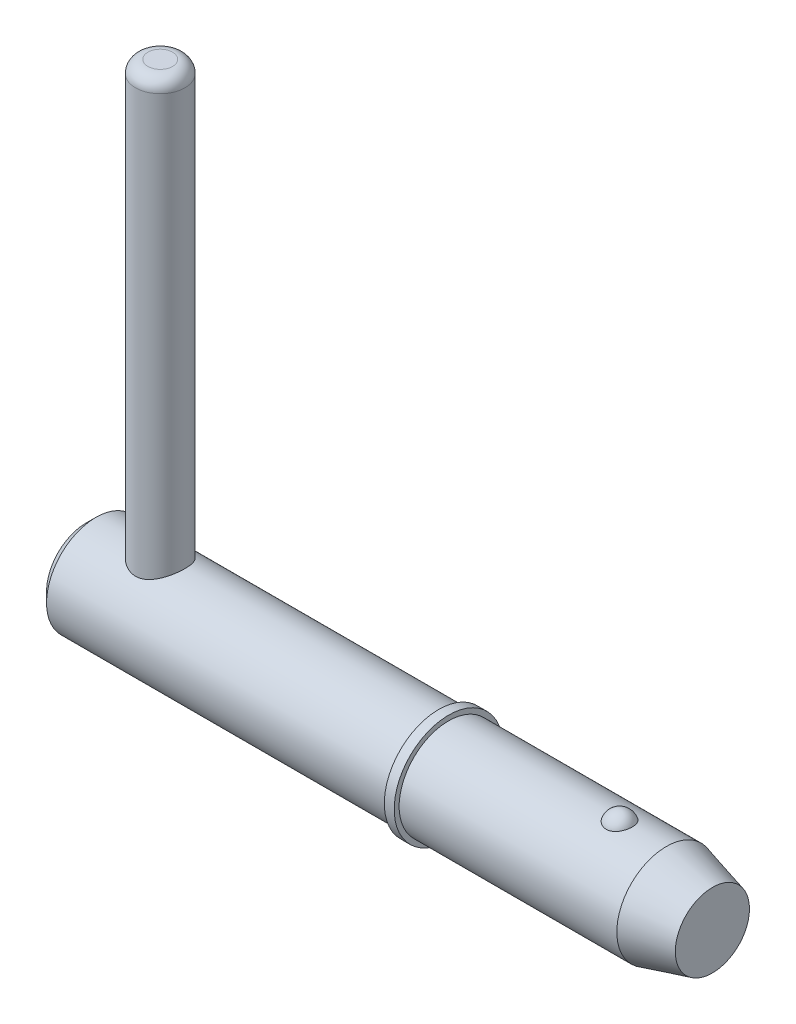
ISO-10303-21;
HEADER;
FILE_DESCRIPTION(('STEP AP214'),'2;1');
FILE_NAME('part.step','',(''),(''),'','','');
FILE_SCHEMA(('AUTOMOTIVE_DESIGN { 1 0 10303 214 1 1 1 1 }'));
ENDSEC;
DATA;
#1=APPLICATION_CONTEXT('core data for automotive mechanical design processes');
#2=APPLICATION_PROTOCOL_DEFINITION('international standard','automotive_design',2000,#1);
#3=PRODUCT_CONTEXT('',#1,'mechanical');
#4=PRODUCT('Part','Part','',(#3));
#5=PRODUCT_RELATED_PRODUCT_CATEGORY('part','',(#4));
#6=PRODUCT_DEFINITION_FORMATION('','',#4);
#7=PRODUCT_DEFINITION_CONTEXT('part definition',#1,'design');
#8=PRODUCT_DEFINITION('design','',#6,#7);
#9=PRODUCT_DEFINITION_SHAPE('','',#8);
#10=(LENGTH_UNIT() NAMED_UNIT(*) SI_UNIT(.MILLI.,.METRE.));
#11=(NAMED_UNIT(*) PLANE_ANGLE_UNIT() SI_UNIT($,.RADIAN.));
#12=(NAMED_UNIT(*) SI_UNIT($,.STERADIAN.) SOLID_ANGLE_UNIT());
#13=UNCERTAINTY_MEASURE_WITH_UNIT(LENGTH_MEASURE(1.E-05),#10,'distance_accuracy_value','');
#14=(GEOMETRIC_REPRESENTATION_CONTEXT(3) GLOBAL_UNCERTAINTY_ASSIGNED_CONTEXT((#13)) GLOBAL_UNIT_ASSIGNED_CONTEXT((#10,
#11,#12)) REPRESENTATION_CONTEXT('',''));
#15=CARTESIAN_POINT('',(0.,0.,0.));
#16=DIRECTION('',(0.,0.,1.));
#17=DIRECTION('',(1.,0.,0.));
#18=AXIS2_PLACEMENT_3D('',#15,#16,#17);
#19=CARTESIAN_POINT('',(3.57,23.02,0.));
#20=DIRECTION('',(0.,-1.,0.));
#21=DIRECTION('',(0.,0.,-1.));
#22=AXIS2_PLACEMENT_3D('',#19,#20,#21);
#23=CYLINDRICAL_SURFACE('',#22,1.19);
#24=CARTESIAN_POINT('',(3.57,-1.785,0.));
#25=DIRECTION('',(0.,1.,0.));
#26=DIRECTION('',(0.,0.,1.));
#27=AXIS2_PLACEMENT_3D('',#24,#25,#26);
#28=CIRCLE('',#27,1.19);
#29=CARTESIAN_POINT('',(3.57,-1.785,1.19));
#30=VERTEX_POINT('',#29);
#31=EDGE_CURVE('P0_E25',#30,#30,#28,.T.);
#32=ORIENTED_EDGE('',*,*,#31,.T.);
#33=EDGE_LOOP('',(#32));
#34=FACE_BOUND('',#33,.T.);
#35=CARTESIAN_POINT('',(3.57,22.425,0.));
#36=DIRECTION('',(0.,1.,0.));
#37=DIRECTION('',(0.,0.,1.));
#38=AXIS2_PLACEMENT_3D('',#35,#36,#37);
#39=CIRCLE('',#38,1.19);
#40=CARTESIAN_POINT('',(3.57,22.425,1.19));
#41=VERTEX_POINT('',#40);
#42=EDGE_CURVE('P0_E29',#41,#41,#39,.F.);
#43=ORIENTED_EDGE('',*,*,#42,.T.);
#44=EDGE_LOOP('',(#43));
#45=FACE_BOUND('',#44,.T.);
#46=ADVANCED_FACE('P0_F14',(#34,#45),#23,.T.);
#47=CARTESIAN_POINT('',(3.57,23.02,0.));
#48=DIRECTION('',(0.,1.,0.));
#49=DIRECTION('',(0.,0.,1.));
#50=AXIS2_PLACEMENT_3D('',#47,#48,#49);
#51=PLANE('',#50);
#52=CARTESIAN_POINT('',(3.57,23.02,0.));
#53=DIRECTION('',(0.,1.,0.));
#54=DIRECTION('',(0.,0.,1.));
#55=AXIS2_PLACEMENT_3D('',#52,#53,#54);
#56=CIRCLE('',#55,0.595);
#57=CARTESIAN_POINT('',(3.57,23.02,0.595));
#58=VERTEX_POINT('',#57);
#59=EDGE_CURVE('P0_E10',#58,#58,#56,.T.);
#60=ORIENTED_EDGE('',*,*,#59,.T.);
#61=EDGE_LOOP('',(#60));
#62=FACE_BOUND('',#61,.T.);
#63=ADVANCED_FACE('P0_F46',(#62),#51,.T.);
#64=CARTESIAN_POINT('',(3.57,-2.38,0.));
#65=DIRECTION('',(0.,1.,0.));
#66=DIRECTION('',(0.,0.,1.));
#67=AXIS2_PLACEMENT_3D('',#64,#65,#66);
#68=PLANE('',#67);
#69=CARTESIAN_POINT('',(3.57,-2.38,0.));
#70=DIRECTION('',(0.,1.,0.));
#71=DIRECTION('',(0.,0.,1.));
#72=AXIS2_PLACEMENT_3D('',#69,#70,#71);
#73=CIRCLE('',#72,0.595);
#74=CARTESIAN_POINT('',(3.57,-2.38,0.595));
#75=VERTEX_POINT('',#74);
#76=EDGE_CURVE('P0_E21',#75,#75,#73,.F.);
#77=ORIENTED_EDGE('',*,*,#76,.T.);
#78=EDGE_LOOP('',(#77));
#79=FACE_BOUND('',#78,.T.);
#80=ADVANCED_FACE('P0_F43',(#79),#68,.F.);
#81=CARTESIAN_POINT('',(3.57,-1.785,0.));
#82=DIRECTION('',(0.,1.,0.));
#83=DIRECTION('',(0.,0.,1.));
#84=AXIS2_PLACEMENT_3D('',#81,#82,#83);
#85=DEGENERATE_TOROIDAL_SURFACE('',#84,0.595,0.595,.T.);
#86=ORIENTED_EDGE('',*,*,#76,.F.);
#87=EDGE_LOOP('',(#86));
#88=FACE_BOUND('',#87,.T.);
#89=ORIENTED_EDGE('',*,*,#31,.F.);
#90=EDGE_LOOP('',(#89));
#91=FACE_BOUND('',#90,.T.);
#92=ADVANCED_FACE('P0_F38',(#88,#91),#85,.T.);
#93=CARTESIAN_POINT('',(3.57,22.425,0.));
#94=DIRECTION('',(0.,1.,0.));
#95=DIRECTION('',(0.,0.,1.));
#96=AXIS2_PLACEMENT_3D('',#93,#94,#95);
#97=DEGENERATE_TOROIDAL_SURFACE('',#96,0.595,0.595,.T.);
#98=ORIENTED_EDGE('',*,*,#42,.F.);
#99=EDGE_LOOP('',(#98));
#100=FACE_BOUND('',#99,.T.);
#101=ORIENTED_EDGE('',*,*,#59,.F.);
#102=EDGE_LOOP('',(#101));
#103=FACE_BOUND('',#102,.T.);
#104=ADVANCED_FACE('P0_F16',(#100,#103),#97,.T.);
#105=CLOSED_SHELL('',(#46,#63,#80,#92,#104));
#106=MANIFOLD_SOLID_BREP('P0_B1',#105);
#107=CARTESIAN_POINT('',(0.,0.,0.));
#108=DIRECTION('',(1.,0.,0.));
#109=DIRECTION('',(0.,0.,-1.));
#110=AXIS2_PLACEMENT_3D('',#107,#108,#109);
#111=CYLINDRICAL_SURFACE('',#110,2.38);
#112=CARTESIAN_POINT('',(27.9294297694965,0.,0.));
#113=DIRECTION('',(1.,0.,0.));
#114=DIRECTION('',(0.,0.,-1.));
#115=AXIS2_PLACEMENT_3D('',#112,#113,#114);
#116=CIRCLE('',#115,2.38);
#117=CARTESIAN_POINT('',(27.9294297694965,0.,-2.38));
#118=VERTEX_POINT('',#117);
#119=EDGE_CURVE('P1_E81',#118,#118,#116,.T.);
#120=ORIENTED_EDGE('',*,*,#119,.F.);
#121=EDGE_LOOP('',(#120));
#122=FACE_BOUND('',#121,.T.);
#123=CARTESIAN_POINT('',(17.45,0.,0.));
#124=DIRECTION('',(1.,0.,0.));
#125=DIRECTION('',(0.,0.,-1.));
#126=AXIS2_PLACEMENT_3D('',#123,#124,#125);
#127=CIRCLE('',#126,2.38);
#128=CARTESIAN_POINT('',(17.45,0.,-2.38));
#129=VERTEX_POINT('',#128);
#130=EDGE_CURVE('P1_E85',#129,#129,#127,.T.);
#131=ORIENTED_EDGE('',*,*,#130,.T.);
#132=EDGE_LOOP('',(#131));
#133=FACE_BOUND('',#132,.T.);
#134=CARTESIAN_POINT('',(25.6834492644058,2.2921568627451,0.640637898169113));
#135=CARTESIAN_POINT('',(25.6503559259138,2.29215737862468,0.64063719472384));
#136=CARTESIAN_POINT('',(25.6172546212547,2.29293179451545,0.637884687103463));
#137=CARTESIAN_POINT('',(25.5520176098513,2.29594030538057,0.626968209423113));
#138=CARTESIAN_POINT('',(25.5198823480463,2.29817506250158,0.618801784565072));
#139=CARTESIAN_POINT('',(25.4575402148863,2.3038430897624,0.597351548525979));
#140=CARTESIAN_POINT('',(25.4273305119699,2.30727454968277,0.584075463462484));
#141=CARTESIAN_POINT('',(25.3695674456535,2.31495941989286,0.552829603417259));
#142=CARTESIAN_POINT('',(25.3420141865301,2.31921286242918,0.53485964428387));
#143=CARTESIAN_POINT('',(25.2895938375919,2.32820213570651,0.494282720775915));
#144=CARTESIAN_POINT('',(25.2648050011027,2.33294694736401,0.471576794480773));
#145=CARTESIAN_POINT('',(25.2192169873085,2.34234144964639,0.422446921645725));
#146=CARTESIAN_POINT('',(25.1984185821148,2.34699112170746,0.396022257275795));
#147=CARTESIAN_POINT('',(25.1603580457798,2.35593942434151,0.338855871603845));
#148=CARTESIAN_POINT('',(25.1433051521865,2.36021170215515,0.307970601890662));
#149=CARTESIAN_POINT('',(25.1143607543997,2.3677057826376,0.243750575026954));
#150=CARTESIAN_POINT('',(25.1024701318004,2.37092740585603,0.210415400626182));
#151=CARTESIAN_POINT('',(25.0838076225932,2.37606901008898,0.141189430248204));
#152=CARTESIAN_POINT('',(25.0771956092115,2.37794816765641,0.105252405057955));
#153=CARTESIAN_POINT('',(25.0698095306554,2.38005135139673,0.0327351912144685));
#154=CARTESIAN_POINT('',(25.0690358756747,2.38027526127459,-0.00384504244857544));
#155=CARTESIAN_POINT('',(25.0733628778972,2.37903842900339,-0.0769838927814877));
#156=CARTESIAN_POINT('',(25.0785202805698,2.37756141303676,-0.113538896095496));
#157=CARTESIAN_POINT('',(25.0947013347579,2.37305303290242,-0.185229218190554));
#158=CARTESIAN_POINT('',(25.1057251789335,2.37002161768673,-0.220364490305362));
#159=CARTESIAN_POINT('',(25.1333977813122,2.36273722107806,-0.288156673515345));
#160=CARTESIAN_POINT('',(25.1500389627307,2.35848588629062,-0.320816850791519));
#161=CARTESIAN_POINT('',(25.1885984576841,2.34923130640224,-0.382744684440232));
#162=CARTESIAN_POINT('',(25.210516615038,2.34422808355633,-0.412012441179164));
#163=CARTESIAN_POINT('',(25.2587549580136,2.33412555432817,-0.465830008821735));
#164=CARTESIAN_POINT('',(25.2850028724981,2.32902887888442,-0.490444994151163));
#165=CARTESIAN_POINT('',(25.3414769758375,2.31926941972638,-0.534700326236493));
#166=CARTESIAN_POINT('',(25.371702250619,2.3146065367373,-0.554341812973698));
#167=CARTESIAN_POINT('',(25.4340618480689,2.30645675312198,-0.58731242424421));
#168=CARTESIAN_POINT('',(25.4660780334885,2.30293152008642,-0.60085527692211));
#169=CARTESIAN_POINT('',(25.5320795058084,2.29725171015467,-0.622220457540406));
#170=CARTESIAN_POINT('',(25.5660641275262,2.29509667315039,-0.630044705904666));
#171=CARTESIAN_POINT('',(25.633299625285,2.29249264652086,-0.639452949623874));
#172=CARTESIAN_POINT('',(25.6665087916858,2.29196755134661,-0.641315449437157));
#173=CARTESIAN_POINT('',(25.732763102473,2.29246849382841,-0.639522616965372));
#174=CARTESIAN_POINT('',(25.7658082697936,2.29349430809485,-0.635868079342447));
#175=CARTESIAN_POINT('',(25.8301025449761,2.29694059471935,-0.623301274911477));
#176=CARTESIAN_POINT('',(25.8613744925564,2.29933234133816,-0.614497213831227));
#177=CARTESIAN_POINT('',(25.9219952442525,2.30522511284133,-0.592006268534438));
#178=CARTESIAN_POINT('',(25.9513438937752,2.30872622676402,-0.57831899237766));
#179=CARTESIAN_POINT('',(26.0080369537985,2.31655795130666,-0.546112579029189));
#180=CARTESIAN_POINT('',(26.035320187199,2.32090569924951,-0.527490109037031));
#181=CARTESIAN_POINT('',(26.0864904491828,2.32992206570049,-0.486117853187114));
#182=CARTESIAN_POINT('',(26.1103767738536,2.33459075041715,-0.463367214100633));
#183=CARTESIAN_POINT('',(26.1552722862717,2.34399834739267,-0.413220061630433));
#184=CARTESIAN_POINT('',(26.1760972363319,2.34873051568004,-0.385657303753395));
#185=CARTESIAN_POINT('',(26.213056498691,2.35754932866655,-0.327455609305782));
#186=CARTESIAN_POINT('',(26.2291898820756,2.36163584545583,-0.2968160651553));
#187=CARTESIAN_POINT('',(26.2569822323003,2.36889321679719,-0.232047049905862));
#188=CARTESIAN_POINT('',(26.2684450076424,2.37202275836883,-0.197828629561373));
#189=CARTESIAN_POINT('',(26.2857523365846,2.37681926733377,-0.127900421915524));
#190=CARTESIAN_POINT('',(26.2915962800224,2.37848607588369,-0.092190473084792));
#191=CARTESIAN_POINT('',(26.297605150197,2.38020024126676,-0.0196348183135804));
#192=CARTESIAN_POINT('',(26.2976704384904,2.38021918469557,0.0172198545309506));
#193=CARTESIAN_POINT('',(26.2918689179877,2.37856356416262,0.0904219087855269));
#194=CARTESIAN_POINT('',(26.2860018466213,2.37688892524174,0.12676926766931));
#195=CARTESIAN_POINT('',(26.268425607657,2.37201688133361,0.198028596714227));
#196=CARTESIAN_POINT('',(26.2566998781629,2.36881516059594,0.232936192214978));
#197=CARTESIAN_POINT('',(26.2276354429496,2.36123444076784,0.300196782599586));
#198=CARTESIAN_POINT('',(26.2102967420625,2.3568554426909,0.33254977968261));
#199=CARTESIAN_POINT('',(26.1705350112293,2.34744667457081,0.393495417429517));
#200=CARTESIAN_POINT('',(26.1481528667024,2.34242227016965,0.422115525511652));
#201=CARTESIAN_POINT('',(26.0987391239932,2.33227293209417,0.475004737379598));
#202=CARTESIAN_POINT('',(26.0717076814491,2.32714800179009,0.499273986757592));
#203=CARTESIAN_POINT('',(26.0144988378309,2.31755359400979,0.542046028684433));
#204=CARTESIAN_POINT('',(25.9844297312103,2.3130698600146,0.560690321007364));
#205=CARTESIAN_POINT('',(25.9213869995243,2.30514125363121,0.592447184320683));
#206=CARTESIAN_POINT('',(25.8884158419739,2.30169550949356,0.605564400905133));
#207=CARTESIAN_POINT('',(25.8268424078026,2.29677744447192,0.623927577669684));
#208=CARTESIAN_POINT('',(25.7985555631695,2.295058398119,0.630178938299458));
#209=CARTESIAN_POINT('',(25.7413308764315,2.29274795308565,0.638534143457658));
#210=CARTESIAN_POINT('',(25.7123931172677,2.29215641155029,0.640638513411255));
#211=CARTESIAN_POINT('',(25.6834492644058,2.2921568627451,0.640637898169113));
#212=B_SPLINE_CURVE_WITH_KNOTS('',3,(#134,#135,#136,#137,#138,#139,#140,#141,#142,#143,#144,
#145,#146,#147,#148,#149,#150,#151,#152,#153,#154,#155,#156,#157,#158,#159,#160,#161,#162,#163,
#164,#165,#166,#167,#168,#169,#170,#171,#172,#173,#174,#175,#176,#177,#178,#179,#180,#181,#182,
#183,#184,#185,#186,#187,#188,#189,#190,#191,#192,#193,#194,#195,#196,#197,#198,#199,#200,#201,
#202,#203,#204,#205,#206,#207,#208,#209,#210,#211),.UNSPECIFIED.,.T.,.F.,(4,2,2,2,2,2,2,2,2,2,2,
2,2,2,2,2,2,2,2,2,2,2,2,2,2,2,2,2,2,2,2,2,2,2,2,2,2,2,4),(0.,0.0991724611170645,
0.19838992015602,0.297457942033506,0.396529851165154,0.49792776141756,0.59934527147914,
0.705475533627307,0.811623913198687,0.920876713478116,1.03013718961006,1.14045177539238,
1.25076998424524,1.36093998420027,1.47110672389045,1.57959248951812,1.68805336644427,
1.79234266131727,1.89659691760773,1.99590391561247,2.09519661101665,2.19247425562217,
2.28975970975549,2.38926978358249,2.48880044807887,2.59293588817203,2.69709193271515,
2.80525821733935,2.91343624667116,3.02347917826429,3.13352698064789,3.24388765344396,
3.35424823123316,3.46374443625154,3.5732369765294,3.67968690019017,3.78604717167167,
3.87279565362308,3.9595331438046),.UNSPECIFIED.);
#213=CARTESIAN_POINT('',(25.6834492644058,2.2921568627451,0.640637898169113));
#214=VERTEX_POINT('',#213);
#215=EDGE_CURVE('P1_E35',#214,#214,#212,.T.);
#216=ORIENTED_EDGE('',*,*,#215,.T.);
#217=EDGE_LOOP('',(#216));
#218=FACE_BOUND('',#217,.T.);
#219=ADVANCED_FACE('P1_F13',(#122,#133,#218),#111,.T.);
#220=CARTESIAN_POINT('',(0.,0.,0.));
#221=DIRECTION('',(-1.,0.,0.));
#222=DIRECTION('',(0.,0.,1.));
#223=AXIS2_PLACEMENT_3D('',#220,#221,#222);
#224=PLANE('',#223);
#225=CARTESIAN_POINT('',(0.,0.,0.));
#226=DIRECTION('',(1.,0.,0.));
#227=DIRECTION('',(0.,0.,-1.));
#228=AXIS2_PLACEMENT_3D('',#225,#226,#227);
#229=CIRCLE('',#228,1.904);
#230=CARTESIAN_POINT('',(0.,0.,-1.904));
#231=VERTEX_POINT('',#230);
#232=EDGE_CURVE('P1_E9',#231,#231,#229,.T.);
#233=ORIENTED_EDGE('',*,*,#232,.F.);
#234=EDGE_LOOP('',(#233));
#235=FACE_BOUND('',#234,.T.);
#236=ADVANCED_FACE('P1_F15',(#235),#224,.T.);
#237=CARTESIAN_POINT('',(0.475999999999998,0.,0.));
#238=DIRECTION('',(1.,0.,0.));
#239=DIRECTION('',(0.,0.,-1.));
#240=AXIS2_PLACEMENT_3D('',#237,#238,#239);
#241=CONICAL_SURFACE('',#240,2.38,0.78539816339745);
#242=ORIENTED_EDGE('',*,*,#232,.T.);
#243=EDGE_LOOP('',(#242));
#244=FACE_BOUND('',#243,.T.);
#245=CARTESIAN_POINT('',(0.475999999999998,0.,0.));
#246=DIRECTION('',(1.,0.,0.));
#247=DIRECTION('',(0.,0.,-1.));
#248=AXIS2_PLACEMENT_3D('',#245,#246,#247);
#249=CIRCLE('',#248,2.38);
#250=CARTESIAN_POINT('',(0.475999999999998,0.,-2.38));
#251=VERTEX_POINT('',#250);
#252=EDGE_CURVE('P1_E26',#251,#251,#249,.T.);
#253=ORIENTED_EDGE('',*,*,#252,.F.);
#254=EDGE_LOOP('',(#253));
#255=FACE_BOUND('',#254,.T.);
#256=ADVANCED_FACE('P1_F77',(#244,#255),#241,.T.);
#257=CARTESIAN_POINT('',(0.,0.,0.));
#258=DIRECTION('',(1.,0.,0.));
#259=DIRECTION('',(0.,0.,-1.));
#260=AXIS2_PLACEMENT_3D('',#257,#258,#259);
#261=CYLINDRICAL_SURFACE('',#260,2.38);
#262=CARTESIAN_POINT('',(3.57,-2.06114046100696,1.19));
#263=CARTESIAN_POINT('',(3.50799170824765,-2.06114586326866,1.18999567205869));
#264=CARTESIAN_POINT('',(3.4459051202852,-2.0639812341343,1.18512096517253));
#265=CARTESIAN_POINT('',(3.32363755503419,-2.07491216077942,1.16587061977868));
#266=CARTESIAN_POINT('',(3.26346086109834,-2.08301876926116,1.15147501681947));
#267=CARTESIAN_POINT('',(3.14701251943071,-2.10331722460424,1.11395893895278));
#268=CARTESIAN_POINT('',(3.09072196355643,-2.1154873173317,1.09088484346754));
#269=CARTESIAN_POINT('',(2.9828251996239,-2.14250771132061,1.03680835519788));
#270=CARTESIAN_POINT('',(2.93121924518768,-2.15735815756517,1.00580553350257));
#271=CARTESIAN_POINT('',(2.82945618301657,-2.18956274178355,0.933753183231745));
#272=CARTESIAN_POINT('',(2.77976962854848,-2.20702235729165,0.892085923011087));
#273=CARTESIAN_POINT('',(2.68772401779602,-2.2416265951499,0.801172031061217));
#274=CARTESIAN_POINT('',(2.64536861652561,-2.25877105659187,0.751921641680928));
#275=CARTESIAN_POINT('',(2.56639309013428,-2.29219557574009,0.64318258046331));
#276=CARTESIAN_POINT('',(2.53035201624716,-2.30833946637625,0.583227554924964));
#277=CARTESIAN_POINT('',(2.46908238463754,-2.3365739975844,0.45714686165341));
#278=CARTESIAN_POINT('',(2.44384700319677,-2.34866719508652,0.391025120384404));
#279=CARTESIAN_POINT('',(2.40676945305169,-2.36667748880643,0.259473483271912));
#280=CARTESIAN_POINT('',(2.39410206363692,-2.37297281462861,0.194329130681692));
#281=CARTESIAN_POINT('',(2.3798023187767,-2.3800902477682,0.0625590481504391));
#282=CARTESIAN_POINT('',(2.37816328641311,-2.38091566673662,-0.00406576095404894));
#283=CARTESIAN_POINT('',(2.38564854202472,-2.37717948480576,-0.130700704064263));
#284=CARTESIAN_POINT('',(2.39384923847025,-2.37308010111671,-0.190782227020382));
#285=CARTESIAN_POINT('',(2.41912820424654,-2.360653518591,-0.308583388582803));
#286=CARTESIAN_POINT('',(2.43620713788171,-2.35232600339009,-0.366302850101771));
#287=CARTESIAN_POINT('',(2.47886825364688,-2.33206184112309,-0.478748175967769));
#288=CARTESIAN_POINT('',(2.50456481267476,-2.32007685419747,-0.533421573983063));
#289=CARTESIAN_POINT('',(2.56357346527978,-2.29357798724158,-0.637812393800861));
#290=CARTESIAN_POINT('',(2.5968882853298,-2.27906320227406,-0.687528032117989));
#291=CARTESIAN_POINT('',(2.67380546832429,-2.24724829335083,-0.785606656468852));
#292=CARTESIAN_POINT('',(2.71808260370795,-2.22981457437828,-0.833397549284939));
#293=CARTESIAN_POINT('',(2.81386177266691,-2.19500665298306,-0.921184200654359));
#294=CARTESIAN_POINT('',(2.86536931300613,-2.17763250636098,-0.961173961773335));
#295=CARTESIAN_POINT('',(2.97815134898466,-2.14371545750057,-1.03471134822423));
#296=CARTESIAN_POINT('',(3.03983836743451,-2.12729540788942,-1.06768860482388));
#297=CARTESIAN_POINT('',(3.16889582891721,-2.09886785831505,-1.12254974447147));
#298=CARTESIAN_POINT('',(3.2362602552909,-2.0868557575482,-1.14444520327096));
#299=CARTESIAN_POINT('',(3.36914526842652,-2.06994116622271,-1.1747444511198));
#300=CARTESIAN_POINT('',(3.43438893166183,-2.06455070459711,-1.18407989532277));
#301=CARTESIAN_POINT('',(3.56571759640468,-2.06010324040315,-1.1918051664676));
#302=CARTESIAN_POINT('',(3.63180197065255,-2.06104176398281,-1.19020272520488));
#303=CARTESIAN_POINT('',(3.75522816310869,-2.06862860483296,-1.17695289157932));
#304=CARTESIAN_POINT('',(3.81273554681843,-2.07464109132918,-1.16642350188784));
#305=CARTESIAN_POINT('',(3.92505766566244,-2.09075885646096,-1.1372785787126));
#306=CARTESIAN_POINT('',(3.97987152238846,-2.1008654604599,-1.1186604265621));
#307=CARTESIAN_POINT('',(4.08813948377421,-2.12458104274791,-1.07296063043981));
#308=CARTESIAN_POINT('',(4.14141303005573,-2.13833055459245,-1.04552693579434));
#309=CARTESIAN_POINT('',(4.2429084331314,-2.16765782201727,-0.983281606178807));
#310=CARTESIAN_POINT('',(4.29112767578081,-2.18323651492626,-0.948466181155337));
#311=CARTESIAN_POINT('',(4.38750473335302,-2.2168271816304,-0.867316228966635));
#312=CARTESIAN_POINT('',(4.43488860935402,-2.23489833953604,-0.82008287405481));
#313=CARTESIAN_POINT('',(4.52130056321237,-2.26973739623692,-0.718051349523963));
#314=CARTESIAN_POINT('',(4.56032581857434,-2.28650485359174,-0.663250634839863));
#315=CARTESIAN_POINT('',(4.62978273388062,-2.31742220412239,-0.545657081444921));
#316=CARTESIAN_POINT('',(4.65996041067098,-2.33149133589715,-0.482691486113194));
#317=CARTESIAN_POINT('',(4.7089941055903,-2.35481192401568,-0.351671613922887));
#318=CARTESIAN_POINT('',(4.7278600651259,-2.36406760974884,-0.283621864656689));
#319=CARTESIAN_POINT('',(4.75210859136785,-2.3760433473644,-0.151105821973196));
#320=CARTESIAN_POINT('',(4.75856947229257,-2.37928514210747,-0.0868836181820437));
#321=CARTESIAN_POINT('',(4.76100348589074,-2.38050135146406,0.0417999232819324));
#322=CARTESIAN_POINT('',(4.75698028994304,-2.37847760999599,0.106261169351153));
#323=CARTESIAN_POINT('',(4.73927447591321,-2.36969422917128,0.229120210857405));
#324=CARTESIAN_POINT('',(4.72624582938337,-2.36325544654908,0.287637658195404));
#325=CARTESIAN_POINT('',(4.69178087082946,-2.34658591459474,0.401560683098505));
#326=CARTESIAN_POINT('',(4.67034335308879,-2.33635462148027,0.456965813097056));
#327=CARTESIAN_POINT('',(4.61871480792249,-2.31247857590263,0.565753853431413));
#328=CARTESIAN_POINT('',(4.58818860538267,-2.29870654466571,0.618948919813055));
#329=CARTESIAN_POINT('',(4.51967006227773,-2.26918878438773,0.719681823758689));
#330=CARTESIAN_POINT('',(4.48167429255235,-2.25344215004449,0.76721704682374));
#331=CARTESIAN_POINT('',(4.39491140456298,-2.21969046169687,0.860267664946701));
#332=CARTESIAN_POINT('',(4.34544863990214,-2.20161660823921,0.905111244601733));
#333=CARTESIAN_POINT('',(4.23943364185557,-2.16655060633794,0.986109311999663));
#334=CARTESIAN_POINT('',(4.18287520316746,-2.1495594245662,1.02225611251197));
#335=CARTESIAN_POINT('',(4.06190239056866,-2.1181953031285,1.08579298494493));
#336=CARTESIAN_POINT('',(3.9972962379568,-2.10392207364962,1.11287022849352));
#337=CARTESIAN_POINT('',(3.86353443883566,-2.08090726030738,1.15534566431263));
#338=CARTESIAN_POINT('',(3.7943948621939,-2.07214719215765,1.17078291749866));
#339=CARTESIAN_POINT('',(3.69875162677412,-2.06499834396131,1.18329673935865));
#340=CARTESIAN_POINT('',(3.67309220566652,-2.06355673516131,1.18580656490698));
#341=CARTESIAN_POINT('',(3.62162638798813,-2.06162663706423,1.18915915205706));
#342=CARTESIAN_POINT('',(3.59581998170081,-2.0611382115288,1.19000180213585));
#343=CARTESIAN_POINT('',(3.57,-2.06114046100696,1.19));
#344=B_SPLINE_CURVE_WITH_KNOTS('',3,(#262,#263,#264,#265,#266,#267,#268,#269,#270,#271,#272,
#273,#274,#275,#276,#277,#278,#279,#280,#281,#282,#283,#284,#285,#286,#287,#288,#289,#290,#291,
#292,#293,#294,#295,#296,#297,#298,#299,#300,#301,#302,#303,#304,#305,#306,#307,#308,#309,#310,
#311,#312,#313,#314,#315,#316,#317,#318,#319,#320,#321,#322,#323,#324,#325,#326,#327,#328,#329,
#330,#331,#332,#333,#334,#335,#336,#337,#338,#339,#340,#341,#342,#343),.UNSPECIFIED.,.T.,.F.,(4,
2,2,2,2,2,2,2,2,2,2,2,2,2,2,2,2,2,2,2,2,2,2,2,2,2,2,2,2,2,2,2,2,2,2,2,2,2,2,2,4),(0.,
0.185916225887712,0.372223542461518,0.557549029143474,0.742884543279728,0.943506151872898,
1.14422749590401,1.35847891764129,1.5725948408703,1.77147547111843,1.97023568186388,
2.15171156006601,2.33320101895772,2.51720146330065,2.70126786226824,2.902733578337,
3.10435357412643,3.31877721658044,3.53297641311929,3.73020126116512,3.92728670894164,
4.1028127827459,4.27839572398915,4.46211082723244,4.64592048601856,4.8529002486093,
5.0599497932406,5.27246375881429,5.48479067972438,5.67763601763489,5.87041383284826,
6.05048865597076,6.23058930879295,6.41839293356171,6.60628297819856,6.8128718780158,
7.01964271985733,7.2329479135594,7.44553408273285,7.52294360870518,7.60035831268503),.UNSPECIFIED.);
#345=CARTESIAN_POINT('',(3.57,-2.06114046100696,1.19));
#346=VERTEX_POINT('',#345);
#347=EDGE_CURVE('P1_E17',#346,#346,#344,.T.);
#348=ORIENTED_EDGE('',*,*,#347,.F.);
#349=EDGE_LOOP('',(#348));
#350=FACE_BOUND('',#349,.T.);
#351=CARTESIAN_POINT('',(3.57,2.06114046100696,1.19));
#352=CARTESIAN_POINT('',(3.63200829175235,2.06114586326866,1.18999567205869));
#353=CARTESIAN_POINT('',(3.6940948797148,2.0639812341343,1.18512096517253));
#354=CARTESIAN_POINT('',(3.81636244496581,2.07491216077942,1.16587061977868));
#355=CARTESIAN_POINT('',(3.87653913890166,2.08301876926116,1.15147501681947));
#356=CARTESIAN_POINT('',(3.99298748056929,2.10331722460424,1.11395893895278));
#357=CARTESIAN_POINT('',(4.04927803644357,2.1154873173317,1.09088484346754));
#358=CARTESIAN_POINT('',(4.1571748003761,2.14250771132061,1.03680835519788));
#359=CARTESIAN_POINT('',(4.20878075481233,2.15735815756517,1.00580553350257));
#360=CARTESIAN_POINT('',(4.31054381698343,2.18956274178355,0.933753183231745));
#361=CARTESIAN_POINT('',(4.36023037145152,2.20702235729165,0.892085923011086));
#362=CARTESIAN_POINT('',(4.45227598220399,2.2416265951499,0.801172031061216));
#363=CARTESIAN_POINT('',(4.49463138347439,2.25877105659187,0.751921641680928));
#364=CARTESIAN_POINT('',(4.57360690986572,2.29219557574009,0.643182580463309));
#365=CARTESIAN_POINT('',(4.60964798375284,2.30833946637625,0.583227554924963));
#366=CARTESIAN_POINT('',(4.67091761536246,2.3365739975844,0.457146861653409));
#367=CARTESIAN_POINT('',(4.69615299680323,2.34866719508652,0.391025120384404));
#368=CARTESIAN_POINT('',(4.73323054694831,2.36667748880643,0.259473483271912));
#369=CARTESIAN_POINT('',(4.74589793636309,2.37297281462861,0.194329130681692));
#370=CARTESIAN_POINT('',(4.7601976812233,2.3800902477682,0.0625590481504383));
#371=CARTESIAN_POINT('',(4.76183671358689,2.38091566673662,-0.00406576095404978));
#372=CARTESIAN_POINT('',(4.75435145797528,2.37717948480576,-0.130700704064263));
#373=CARTESIAN_POINT('',(4.74615076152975,2.37308010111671,-0.190782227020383));
#374=CARTESIAN_POINT('',(4.72087179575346,2.360653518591,-0.308583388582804));
#375=CARTESIAN_POINT('',(4.70379286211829,2.35232600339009,-0.366302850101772));
#376=CARTESIAN_POINT('',(4.66113174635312,2.33206184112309,-0.478748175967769));
#377=CARTESIAN_POINT('',(4.63543518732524,2.32007685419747,-0.533421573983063));
#378=CARTESIAN_POINT('',(4.57642653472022,2.29357798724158,-0.637812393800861));
#379=CARTESIAN_POINT('',(4.5431117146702,2.27906320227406,-0.687528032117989));
#380=CARTESIAN_POINT('',(4.46619453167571,2.24724829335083,-0.785606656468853));
#381=CARTESIAN_POINT('',(4.42191739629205,2.22981457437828,-0.83339754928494));
#382=CARTESIAN_POINT('',(4.32613822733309,2.19500665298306,-0.921184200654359));
#383=CARTESIAN_POINT('',(4.27463068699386,2.17763250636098,-0.961173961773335));
#384=CARTESIAN_POINT('',(4.16184865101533,2.14371545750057,-1.03471134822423));
#385=CARTESIAN_POINT('',(4.10016163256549,2.12729540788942,-1.06768860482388));
#386=CARTESIAN_POINT('',(3.97110417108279,2.09886785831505,-1.12254974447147));
#387=CARTESIAN_POINT('',(3.9037397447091,2.0868557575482,-1.14444520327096));
#388=CARTESIAN_POINT('',(3.77085473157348,2.06994116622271,-1.1747444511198));
#389=CARTESIAN_POINT('',(3.70561106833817,2.06455070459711,-1.18407989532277));
#390=CARTESIAN_POINT('',(3.57428240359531,2.06010324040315,-1.1918051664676));
#391=CARTESIAN_POINT('',(3.50819802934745,2.06104176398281,-1.19020272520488));
#392=CARTESIAN_POINT('',(3.38477183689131,2.06862860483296,-1.17695289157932));
#393=CARTESIAN_POINT('',(3.32726445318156,2.07464109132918,-1.16642350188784));
#394=CARTESIAN_POINT('',(3.21494233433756,2.09075885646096,-1.1372785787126));
#395=CARTESIAN_POINT('',(3.16012847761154,2.1008654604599,-1.1186604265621));
#396=CARTESIAN_POINT('',(3.05186051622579,2.12458104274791,-1.07296063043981));
#397=CARTESIAN_POINT('',(2.99858696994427,2.13833055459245,-1.04552693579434));
#398=CARTESIAN_POINT('',(2.8970915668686,2.16765782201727,-0.983281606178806));
#399=CARTESIAN_POINT('',(2.84887232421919,2.18323651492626,-0.948466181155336));
#400=CARTESIAN_POINT('',(2.75249526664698,2.2168271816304,-0.867316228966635));
#401=CARTESIAN_POINT('',(2.70511139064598,2.23489833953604,-0.820082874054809));
#402=CARTESIAN_POINT('',(2.61869943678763,2.26973739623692,-0.718051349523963));
#403=CARTESIAN_POINT('',(2.57967418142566,2.28650485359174,-0.663250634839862));
#404=CARTESIAN_POINT('',(2.51021726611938,2.31742220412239,-0.54565708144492));
#405=CARTESIAN_POINT('',(2.48003958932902,2.33149133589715,-0.482691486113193));
#406=CARTESIAN_POINT('',(2.4310058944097,2.35481192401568,-0.351671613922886));
#407=CARTESIAN_POINT('',(2.4121399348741,2.36406760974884,-0.283621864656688));
#408=CARTESIAN_POINT('',(2.38789140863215,2.3760433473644,-0.151105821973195));
#409=CARTESIAN_POINT('',(2.38143052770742,2.37928514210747,-0.0868836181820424));
#410=CARTESIAN_POINT('',(2.37899651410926,2.38050135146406,0.0417999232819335));
#411=CARTESIAN_POINT('',(2.38301971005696,2.37847760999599,0.106261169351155));
#412=CARTESIAN_POINT('',(2.40072552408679,2.36969422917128,0.229120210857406));
#413=CARTESIAN_POINT('',(2.41375417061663,2.36325544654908,0.287637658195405));
#414=CARTESIAN_POINT('',(2.44821912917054,2.34658591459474,0.401560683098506));
#415=CARTESIAN_POINT('',(2.46965664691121,2.33635462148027,0.456965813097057));
#416=CARTESIAN_POINT('',(2.52128519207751,2.31247857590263,0.565753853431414));
#417=CARTESIAN_POINT('',(2.55181139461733,2.29870654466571,0.618948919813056));
#418=CARTESIAN_POINT('',(2.62032993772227,2.26918878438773,0.719681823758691));
#419=CARTESIAN_POINT('',(2.65832570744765,2.25344215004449,0.767217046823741));
#420=CARTESIAN_POINT('',(2.74508859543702,2.21969046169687,0.860267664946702));
#421=CARTESIAN_POINT('',(2.79455136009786,2.20161660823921,0.905111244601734));
#422=CARTESIAN_POINT('',(2.90056635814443,2.16655060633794,0.986109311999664));
#423=CARTESIAN_POINT('',(2.95712479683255,2.1495594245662,1.02225611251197));
#424=CARTESIAN_POINT('',(3.07809760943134,2.1181953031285,1.08579298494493));
#425=CARTESIAN_POINT('',(3.1427037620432,2.10392207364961,1.11287022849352));
#426=CARTESIAN_POINT('',(3.27646556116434,2.08090726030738,1.15534566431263));
#427=CARTESIAN_POINT('',(3.3456051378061,2.07214719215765,1.17078291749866));
#428=CARTESIAN_POINT('',(3.44124837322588,2.06499834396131,1.18329673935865));
#429=CARTESIAN_POINT('',(3.46690779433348,2.06355673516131,1.18580656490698));
#430=CARTESIAN_POINT('',(3.51837361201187,2.06162663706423,1.18915915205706));
#431=CARTESIAN_POINT('',(3.54418001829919,2.0611382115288,1.19000180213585));
#432=CARTESIAN_POINT('',(3.57,2.06114046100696,1.19));
#433=B_SPLINE_CURVE_WITH_KNOTS('',3,(#351,#352,#353,#354,#355,#356,#357,#358,#359,#360,#361,
#362,#363,#364,#365,#366,#367,#368,#369,#370,#371,#372,#373,#374,#375,#376,#377,#378,#379,#380,
#381,#382,#383,#384,#385,#386,#387,#388,#389,#390,#391,#392,#393,#394,#395,#396,#397,#398,#399,
#400,#401,#402,#403,#404,#405,#406,#407,#408,#409,#410,#411,#412,#413,#414,#415,#416,#417,#418,
#419,#420,#421,#422,#423,#424,#425,#426,#427,#428,#429,#430,#431,#432),.UNSPECIFIED.,.T.,.F.,(4,
2,2,2,2,2,2,2,2,2,2,2,2,2,2,2,2,2,2,2,2,2,2,2,2,2,2,2,2,2,2,2,2,2,2,2,2,2,2,2,4),(0.,
0.185916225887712,0.372223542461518,0.557549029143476,0.74288454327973,0.9435061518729,
1.14422749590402,1.35847891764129,1.5725948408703,1.77147547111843,1.97023568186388,
2.15171156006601,2.33320101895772,2.51720146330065,2.70126786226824,2.902733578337,
3.10435357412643,3.31877721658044,3.53297641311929,3.73020126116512,3.92728670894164,
4.1028127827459,4.27839572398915,4.46211082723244,4.64592048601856,4.8529002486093,
5.05994979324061,5.27246375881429,5.48479067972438,5.67763601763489,5.87041383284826,
6.05048865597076,6.23058930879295,6.41839293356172,6.60628297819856,6.8128718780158,
7.01964271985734,7.2329479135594,7.44553408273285,7.52294360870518,7.60035831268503),.UNSPECIFIED.);
#434=CARTESIAN_POINT('',(3.57,2.06114046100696,1.19));
#435=VERTEX_POINT('',#434);
#436=EDGE_CURVE('P1_E43',#435,#435,#433,.T.);
#437=ORIENTED_EDGE('',*,*,#436,.F.);
#438=EDGE_LOOP('',(#437));
#439=FACE_BOUND('',#438,.T.);
#440=ORIENTED_EDGE('',*,*,#252,.T.);
#441=EDGE_LOOP('',(#440));
#442=FACE_BOUND('',#441,.T.);
#443=CARTESIAN_POINT('',(16.974,0.,0.));
#444=DIRECTION('',(1.,0.,0.));
#445=DIRECTION('',(0.,0.,-1.));
#446=AXIS2_PLACEMENT_3D('',#443,#444,#445);
#447=CIRCLE('',#446,2.38);
#448=CARTESIAN_POINT('',(16.974,0.,-2.38));
#449=VERTEX_POINT('',#448);
#450=EDGE_CURVE('P1_E31',#449,#449,#447,.T.);
#451=ORIENTED_EDGE('',*,*,#450,.F.);
#452=EDGE_LOOP('',(#451));
#453=FACE_BOUND('',#452,.T.);
#454=ADVANCED_FACE('P1_F103',(#350,#439,#442,#453),#261,.T.);
#455=CARTESIAN_POINT('',(16.974,2.38,0.));
#456=DIRECTION('',(-1.,0.,0.));
#457=DIRECTION('',(0.,0.,1.));
#458=AXIS2_PLACEMENT_3D('',#455,#456,#457);
#459=PLANE('',#458);
#460=ORIENTED_EDGE('',*,*,#450,.T.);
#461=EDGE_LOOP('',(#460));
#462=FACE_BOUND('',#461,.T.);
#463=CARTESIAN_POINT('',(16.974,0.,0.));
#464=DIRECTION('',(1.,0.,0.));
#465=DIRECTION('',(0.,0.,-1.));
#466=AXIS2_PLACEMENT_3D('',#463,#464,#465);
#467=CIRCLE('',#466,2.618);
#468=CARTESIAN_POINT('',(16.974,0.,-2.618));
#469=VERTEX_POINT('',#468);
#470=EDGE_CURVE('P1_E91',#469,#469,#467,.T.);
#471=ORIENTED_EDGE('',*,*,#470,.F.);
#472=EDGE_LOOP('',(#471));
#473=FACE_BOUND('',#472,.T.);
#474=ADVANCED_FACE('P1_F100',(#462,#473),#459,.T.);
#475=CARTESIAN_POINT('',(0.,0.,0.));
#476=DIRECTION('',(1.,0.,0.));
#477=DIRECTION('',(0.,0.,-1.));
#478=AXIS2_PLACEMENT_3D('',#475,#476,#477);
#479=CYLINDRICAL_SURFACE('',#478,2.618);
#480=ORIENTED_EDGE('',*,*,#470,.T.);
#481=EDGE_LOOP('',(#480));
#482=FACE_BOUND('',#481,.T.);
#483=CARTESIAN_POINT('',(17.45,0.,0.));
#484=DIRECTION('',(1.,0.,0.));
#485=DIRECTION('',(0.,0.,-1.));
#486=AXIS2_PLACEMENT_3D('',#483,#484,#485);
#487=CIRCLE('',#486,2.618);
#488=CARTESIAN_POINT('',(17.45,0.,-2.618));
#489=VERTEX_POINT('',#488);
#490=EDGE_CURVE('P1_E88',#489,#489,#487,.T.);
#491=ORIENTED_EDGE('',*,*,#490,.F.);
#492=EDGE_LOOP('',(#491));
#493=FACE_BOUND('',#492,.T.);
#494=ADVANCED_FACE('P1_F68',(#482,#493),#479,.T.);
#495=CARTESIAN_POINT('',(17.45,2.618,0.));
#496=DIRECTION('',(1.,0.,0.));
#497=DIRECTION('',(0.,0.,-1.));
#498=AXIS2_PLACEMENT_3D('',#495,#496,#497);
#499=PLANE('',#498);
#500=ORIENTED_EDGE('',*,*,#490,.T.);
#501=EDGE_LOOP('',(#500));
#502=FACE_BOUND('',#501,.T.);
#503=ORIENTED_EDGE('',*,*,#130,.F.);
#504=EDGE_LOOP('',(#503));
#505=FACE_BOUND('',#504,.T.);
#506=ADVANCED_FACE('P1_F62',(#502,#505),#499,.T.);
#507=CARTESIAN_POINT('',(30.15,0.,0.));
#508=DIRECTION('',(-1.,0.,0.));
#509=DIRECTION('',(0.,0.,1.));
#510=AXIS2_PLACEMENT_3D('',#507,#508,#509);
#511=CONICAL_SURFACE('',#510,1.785,0.261799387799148);
#512=ORIENTED_EDGE('',*,*,#119,.T.);
#513=EDGE_LOOP('',(#512));
#514=FACE_BOUND('',#513,.T.);
#515=CARTESIAN_POINT('',(30.15,0.,0.));
#516=DIRECTION('',(1.,0.,0.));
#517=DIRECTION('',(0.,0.,-1.));
#518=AXIS2_PLACEMENT_3D('',#515,#516,#517);
#519=CIRCLE('',#518,1.785);
#520=CARTESIAN_POINT('',(30.15,0.,-1.785));
#521=VERTEX_POINT('',#520);
#522=EDGE_CURVE('P1_E42',#521,#521,#519,.T.);
#523=ORIENTED_EDGE('',*,*,#522,.F.);
#524=EDGE_LOOP('',(#523));
#525=FACE_BOUND('',#524,.T.);
#526=ADVANCED_FACE('P1_F59',(#514,#525),#511,.T.);
#527=CARTESIAN_POINT('',(30.15,1.785,0.));
#528=DIRECTION('',(1.,0.,0.));
#529=DIRECTION('',(0.,0.,-1.));
#530=AXIS2_PLACEMENT_3D('',#527,#528,#529);
#531=PLANE('',#530);
#532=ORIENTED_EDGE('',*,*,#522,.T.);
#533=EDGE_LOOP('',(#532));
#534=FACE_BOUND('',#533,.T.);
#535=ADVANCED_FACE('P1_F55',(#534),#531,.T.);
#536=CARTESIAN_POINT('',(25.6834492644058,2.142,0.));
#537=DIRECTION('',(-1.,0.,0.));
#538=DIRECTION('',(0.,1.,0.));
#539=AXIS2_PLACEMENT_3D('',#536,#537,#538);
#540=SPHERICAL_SURFACE('',#539,0.657999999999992);
#541=ORIENTED_EDGE('',*,*,#215,.F.);
#542=EDGE_LOOP('',(#541));
#543=FACE_BOUND('',#542,.T.);
#544=ADVANCED_FACE('P1_F50',(#543),#540,.T.);
#545=CARTESIAN_POINT('',(3.57,-2.618,0.));
#546=DIRECTION('',(0.,1.,0.));
#547=DIRECTION('',(0.,0.,1.));
#548=AXIS2_PLACEMENT_3D('',#545,#546,#547);
#549=CYLINDRICAL_SURFACE('',#548,1.19);
#550=ORIENTED_EDGE('',*,*,#347,.T.);
#551=EDGE_LOOP('',(#550));
#552=FACE_BOUND('',#551,.T.);
#553=ORIENTED_EDGE('',*,*,#436,.T.);
#554=EDGE_LOOP('',(#553));
#555=FACE_BOUND('',#554,.T.);
#556=ADVANCED_FACE('P1_F54',(#552,#555),#549,.F.);
#557=CLOSED_SHELL('',(#219,#236,#256,#454,#474,#494,#506,#526,#535,#544,#556));
#558=MANIFOLD_SOLID_BREP('P1_B1',#557);
#559=ADVANCED_BREP_SHAPE_REPRESENTATION('',(#18,#106,#558),#14);
#560=SHAPE_DEFINITION_REPRESENTATION(#9,#559);
ENDSEC;
END-ISO-10303-21;
